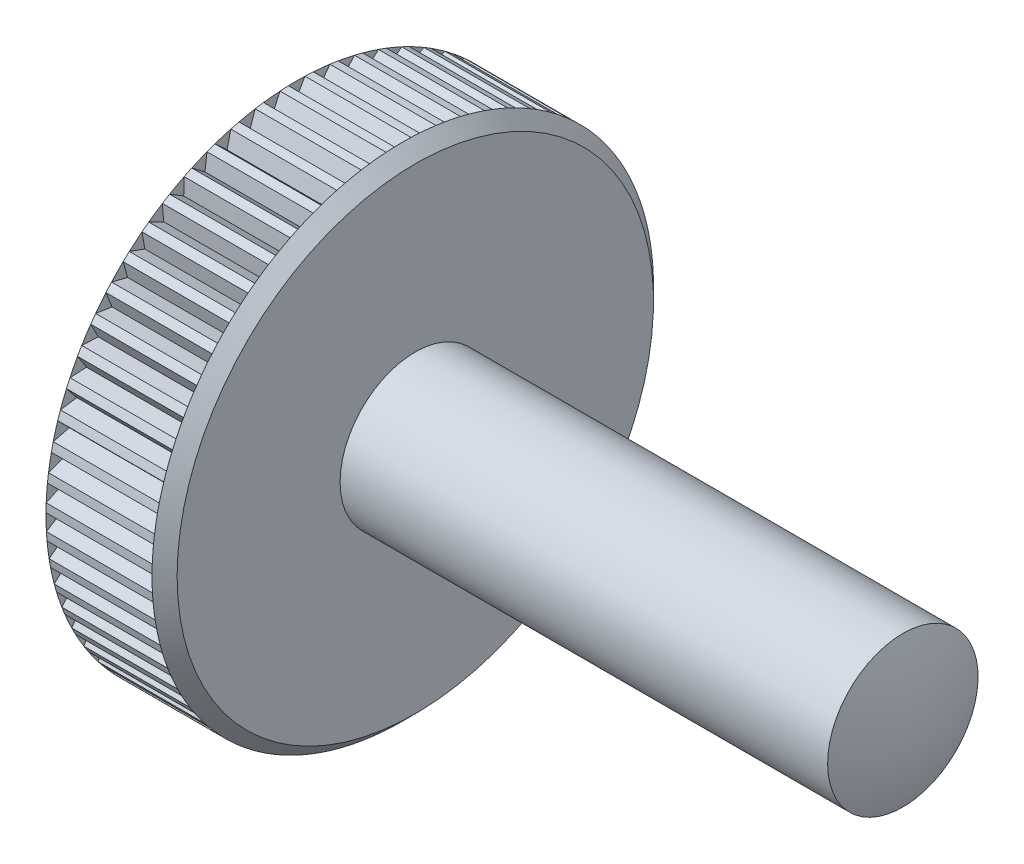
from build123d import *

# Parameters (mm, degrees)
CHAMFER1_SIZE           = 0.5
CUT_EXTRUDE1_DEPTH      = 4.23
CIRCULAR_PATTERN1_COUNT = 63


with BuildPart() as part:
    # Sketch1 → Base (revolve)
    with BuildSketch(Plane.XY):
        with BuildLine():
            Line((0, 0), (26, 0))
            ThreePointArc((26, 0), (25.860343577, 1.525360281), (25.446018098, 3))
            Line((25.446018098, 3), (6, 3))
            Line((6, 3), (6, 10))
            Line((6, 10), (1.270166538, 10))
            ThreePointArc((1.270166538, 10), (0.318812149, 5.040171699), (0, 0))
        make_face()
    revolve(axis=Axis((-48.211075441, 0, 0), (1, 0, 0)))

    # Chamfer1
    chamfer1_edges = [part.edges().sort_by_distance(p)[0] for p in [
        (6, -10, 0),
    ]]
    chamfer(chamfer1_edges, length=CHAMFER1_SIZE)

    # Sketch2 → Cut-Extrude1 (cut)
    with BuildSketch(Plane(origin=(1.27, 0, 0), x_dir=(0, 0, -1), z_dir=(1, 0, 0))):
        Polygon((0, 9.422649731), (0.5, 10.288675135), (-0.5, 10.288675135), align=None)
    cut_extrude1 = extrude(amount=CUT_EXTRUDE1_DEPTH, mode=Mode.SUBTRACT)

    # Circular-Pattern1: Cut-Extrude1 ×63 about axis
    circular_pattern1_axis = Axis((0, 0, 0), (1, 0, 0))
    for i in range(1, CIRCULAR_PATTERN1_COUNT):
        add(cut_extrude1.rotate(circular_pattern1_axis, i * 360 / CIRCULAR_PATTERN1_COUNT), mode=Mode.SUBTRACT)


solid = part.part
